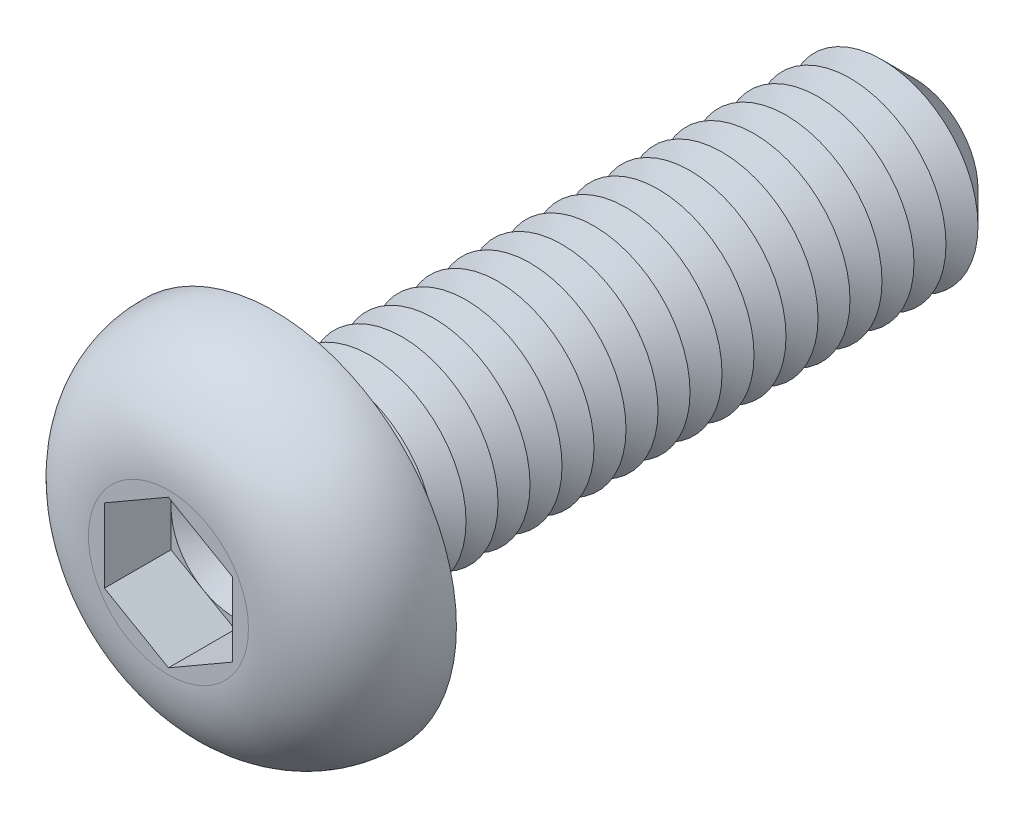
ISO-10303-21;
HEADER;
FILE_DESCRIPTION(('STEP AP214'),'2;1');
FILE_NAME('part.step','',(''),(''),'','','');
FILE_SCHEMA(('AUTOMOTIVE_DESIGN { 1 0 10303 214 1 1 1 1 }'));
ENDSEC;
DATA;
#1=APPLICATION_CONTEXT('core data for automotive mechanical design processes');
#2=APPLICATION_PROTOCOL_DEFINITION('international standard','automotive_design',2000,#1);
#3=PRODUCT_CONTEXT('',#1,'mechanical');
#4=PRODUCT('Part','Part','',(#3));
#5=PRODUCT_RELATED_PRODUCT_CATEGORY('part','',(#4));
#6=PRODUCT_DEFINITION_FORMATION('','',#4);
#7=PRODUCT_DEFINITION_CONTEXT('part definition',#1,'design');
#8=PRODUCT_DEFINITION('design','',#6,#7);
#9=PRODUCT_DEFINITION_SHAPE('','',#8);
#10=(LENGTH_UNIT() NAMED_UNIT(*) SI_UNIT(.MILLI.,.METRE.));
#11=(NAMED_UNIT(*) PLANE_ANGLE_UNIT() SI_UNIT($,.RADIAN.));
#12=(NAMED_UNIT(*) SI_UNIT($,.STERADIAN.) SOLID_ANGLE_UNIT());
#13=UNCERTAINTY_MEASURE_WITH_UNIT(LENGTH_MEASURE(1.E-05),#10,'distance_accuracy_value','');
#14=(GEOMETRIC_REPRESENTATION_CONTEXT(3) GLOBAL_UNCERTAINTY_ASSIGNED_CONTEXT((#13)) GLOBAL_UNIT_ASSIGNED_CONTEXT((#10,
#11,#12)) REPRESENTATION_CONTEXT('',''));
#15=CARTESIAN_POINT('',(0.,0.,0.));
#16=DIRECTION('',(0.,0.,1.));
#17=DIRECTION('',(1.,0.,0.));
#18=AXIS2_PLACEMENT_3D('',#15,#16,#17);
#19=CARTESIAN_POINT('',(0.,0.,0.61));
#20=DIRECTION('',(0.,0.,1.));
#21=DIRECTION('',(1.,0.,0.));
#22=AXIS2_PLACEMENT_3D('',#19,#20,#21);
#23=PLANE('',#22);
#24=CARTESIAN_POINT('',(0.,0.,0.61));
#25=DIRECTION('',(0.,0.,1.));
#26=DIRECTION('',(1.,0.,0.));
#27=AXIS2_PLACEMENT_3D('',#24,#25,#26);
#28=CIRCLE('',#27,1.);
#29=CARTESIAN_POINT('',(1.,0.,0.61));
#30=VERTEX_POINT('',#29);
#31=CARTESIAN_POINT('',(0.5,0.866025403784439,0.61));
#32=VERTEX_POINT('',#31);
#33=EDGE_CURVE('E117',#30,#32,#28,.T.);
#34=ORIENTED_EDGE('',*,*,#33,.F.);
#35=DIRECTION('',(0.,1.,0.));
#36=VECTOR('',#35,1.);
#37=CARTESIAN_POINT('',(1.,-0.577350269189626,0.61));
#38=LINE('',#37,#36);
#39=CARTESIAN_POINT('',(1.,0.577350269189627,0.61));
#40=VERTEX_POINT('',#39);
#41=EDGE_CURVE('E140',#30,#40,#38,.T.);
#42=ORIENTED_EDGE('',*,*,#41,.T.);
#43=DIRECTION('',(-0.866025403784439,0.5,0.));
#44=VECTOR('',#43,1.);
#45=CARTESIAN_POINT('',(1.,0.577350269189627,0.61));
#46=LINE('',#45,#44);
#47=EDGE_CURVE('E135',#40,#32,#46,.T.);
#48=ORIENTED_EDGE('',*,*,#47,.T.);
#49=EDGE_LOOP('',(#34,#42,#48));
#50=FACE_BOUND('',#49,.T.);
#51=ADVANCED_FACE('F39',(#50),#23,.T.);
#52=CARTESIAN_POINT('',(0.,0.,0.61));
#53=DIRECTION('',(0.,0.,1.));
#54=DIRECTION('',(1.,0.,0.));
#55=AXIS2_PLACEMENT_3D('',#52,#53,#54);
#56=CIRCLE('',#55,1.);
#57=CARTESIAN_POINT('',(-0.5,0.866025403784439,0.61));
#58=VERTEX_POINT('',#57);
#59=EDGE_CURVE('E11',#32,#58,#56,.T.);
#60=ORIENTED_EDGE('',*,*,#59,.F.);
#61=CARTESIAN_POINT('',(0.,1.15470053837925,0.61));
#62=VERTEX_POINT('',#61);
#63=EDGE_CURVE('E130',#32,#62,#46,.T.);
#64=ORIENTED_EDGE('',*,*,#63,.T.);
#65=DIRECTION('',(-0.866025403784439,-0.5,0.));
#66=VECTOR('',#65,1.);
#67=CARTESIAN_POINT('',(0.,1.15470053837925,0.61));
#68=LINE('',#67,#66);
#69=EDGE_CURVE('E132',#62,#58,#68,.T.);
#70=ORIENTED_EDGE('',*,*,#69,.T.);
#71=EDGE_LOOP('',(#60,#64,#70));
#72=FACE_BOUND('',#71,.T.);
#73=ADVANCED_FACE('F129',(#72),#23,.T.);
#74=CARTESIAN_POINT('',(-1.,0.,0.61));
#75=VERTEX_POINT('',#74);
#76=EDGE_CURVE('E49',#58,#75,#56,.T.);
#77=ORIENTED_EDGE('',*,*,#76,.F.);
#78=CARTESIAN_POINT('',(-1.,0.577350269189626,0.61));
#79=VERTEX_POINT('',#78);
#80=EDGE_CURVE('E143',#58,#79,#68,.T.);
#81=ORIENTED_EDGE('',*,*,#80,.T.);
#82=DIRECTION('',(0.,-1.,0.));
#83=VECTOR('',#82,1.);
#84=CARTESIAN_POINT('',(-1.,0.577350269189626,0.61));
#85=LINE('',#84,#83);
#86=EDGE_CURVE('E154',#79,#75,#85,.T.);
#87=ORIENTED_EDGE('',*,*,#86,.T.);
#88=EDGE_LOOP('',(#77,#81,#87));
#89=FACE_BOUND('',#88,.T.);
#90=ADVANCED_FACE('F250',(#89),#23,.T.);
#91=CARTESIAN_POINT('',(-0.5,-0.866025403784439,0.61));
#92=VERTEX_POINT('',#91);
#93=EDGE_CURVE('E234',#75,#92,#56,.T.);
#94=ORIENTED_EDGE('',*,*,#93,.F.);
#95=CARTESIAN_POINT('',(-1.,-0.577350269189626,0.61));
#96=VERTEX_POINT('',#95);
#97=EDGE_CURVE('E153',#75,#96,#85,.T.);
#98=ORIENTED_EDGE('',*,*,#97,.T.);
#99=DIRECTION('',(0.866025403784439,-0.5,0.));
#100=VECTOR('',#99,1.);
#101=CARTESIAN_POINT('',(-1.,-0.577350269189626,0.61));
#102=LINE('',#101,#100);
#103=EDGE_CURVE('E159',#96,#92,#102,.T.);
#104=ORIENTED_EDGE('',*,*,#103,.T.);
#105=EDGE_LOOP('',(#94,#98,#104));
#106=FACE_BOUND('',#105,.T.);
#107=ADVANCED_FACE('F243',(#106),#23,.T.);
#108=CARTESIAN_POINT('',(0.5,-0.866025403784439,0.61));
#109=VERTEX_POINT('',#108);
#110=EDGE_CURVE('E56',#92,#109,#56,.T.);
#111=ORIENTED_EDGE('',*,*,#110,.F.);
#112=CARTESIAN_POINT('',(0.,-1.15470053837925,0.61));
#113=VERTEX_POINT('',#112);
#114=EDGE_CURVE('E158',#92,#113,#102,.T.);
#115=ORIENTED_EDGE('',*,*,#114,.T.);
#116=DIRECTION('',(0.866025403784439,0.5,0.));
#117=VECTOR('',#116,1.);
#118=CARTESIAN_POINT('',(0.,-1.15470053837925,0.61));
#119=LINE('',#118,#117);
#120=EDGE_CURVE('E164',#113,#109,#119,.T.);
#121=ORIENTED_EDGE('',*,*,#120,.T.);
#122=EDGE_LOOP('',(#111,#115,#121));
#123=FACE_BOUND('',#122,.T.);
#124=ADVANCED_FACE('F336',(#123),#23,.T.);
#125=CARTESIAN_POINT('',(0.,0.,-10.));
#126=DIRECTION('',(0.,0.,1.));
#127=DIRECTION('',(1.,0.,0.));
#128=AXIS2_PLACEMENT_3D('',#125,#126,#127);
#129=CYLINDRICAL_SURFACE('',#128,1.5);
#130=CARTESIAN_POINT('',(0.,0.,-0.200000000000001));
#131=DIRECTION('',(0.,0.,1.));
#132=DIRECTION('',(1.,0.,0.));
#133=AXIS2_PLACEMENT_3D('',#130,#131,#132);
#134=CIRCLE('',#133,1.5);
#135=CARTESIAN_POINT('',(1.5,0.,-0.200000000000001));
#136=VERTEX_POINT('',#135);
#137=EDGE_CURVE('E222',#136,#136,#134,.F.);
#138=ORIENTED_EDGE('',*,*,#137,.T.);
#139=EDGE_LOOP('',(#138));
#140=FACE_BOUND('',#139,.T.);
#141=CARTESIAN_POINT('',(0.,0.,-0.5));
#142=DIRECTION('',(0.,0.,1.));
#143=DIRECTION('',(1.,0.,0.));
#144=AXIS2_PLACEMENT_3D('',#141,#142,#143);
#145=CIRCLE('',#144,1.50000000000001);
#146=CARTESIAN_POINT('',(1.50000000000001,0.,-0.5));
#147=VERTEX_POINT('',#146);
#148=EDGE_CURVE('E149',#147,#147,#145,.T.);
#149=ORIENTED_EDGE('',*,*,#148,.T.);
#150=EDGE_LOOP('',(#149));
#151=FACE_BOUND('',#150,.T.);
#152=ADVANCED_FACE('F320',(#140,#151),#129,.T.);
#153=CARTESIAN_POINT('',(0.,2.85,0.));
#154=DIRECTION('',(0.,0.,1.));
#155=DIRECTION('',(1.,0.,0.));
#156=AXIS2_PLACEMENT_3D('',#153,#154,#155);
#157=PLANE('',#156);
#158=CARTESIAN_POINT('',(0.,0.,0.));
#159=DIRECTION('',(0.,0.,1.));
#160=DIRECTION('',(1.,0.,0.));
#161=AXIS2_PLACEMENT_3D('',#158,#159,#160);
#162=CIRCLE('',#161,1.7);
#163=CARTESIAN_POINT('',(1.7,0.,0.));
#164=VERTEX_POINT('',#163);
#165=EDGE_CURVE('E225',#164,#164,#162,.T.);
#166=ORIENTED_EDGE('',*,*,#165,.T.);
#167=EDGE_LOOP('',(#166));
#168=FACE_BOUND('',#167,.T.);
#169=CARTESIAN_POINT('',(0.,0.,0.));
#170=DIRECTION('',(0.,0.,1.));
#171=DIRECTION('',(1.,0.,0.));
#172=AXIS2_PLACEMENT_3D('',#169,#170,#171);
#173=CIRCLE('',#172,2.85);
#174=CARTESIAN_POINT('',(2.85,0.,0.));
#175=VERTEX_POINT('',#174);
#176=EDGE_CURVE('E196',#175,#175,#173,.T.);
#177=ORIENTED_EDGE('',*,*,#176,.F.);
#178=EDGE_LOOP('',(#177));
#179=FACE_BOUND('',#178,.T.);
#180=ADVANCED_FACE('F366',(#168,#179),#157,.F.);
#181=CARTESIAN_POINT('',(0.,0.,1.65));
#182=DIRECTION('',(0.,0.,-1.));
#183=DIRECTION('',(-1.,0.,0.));
#184=AXIS2_PLACEMENT_3D('',#181,#182,#183);
#185=PLANE('',#184);
#186=DIRECTION('',(-0.866025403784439,-0.5,0.));
#187=VECTOR('',#186,1.);
#188=CARTESIAN_POINT('',(0.,1.15470053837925,1.65));
#189=LINE('',#188,#187);
#190=CARTESIAN_POINT('',(0.,1.15470053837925,1.65));
#191=VERTEX_POINT('',#190);
#192=CARTESIAN_POINT('',(-1.,0.577350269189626,1.65));
#193=VERTEX_POINT('',#192);
#194=EDGE_CURVE('E174',#191,#193,#189,.T.);
#195=ORIENTED_EDGE('',*,*,#194,.F.);
#196=DIRECTION('',(-0.866025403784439,0.5,0.));
#197=VECTOR('',#196,1.);
#198=CARTESIAN_POINT('',(1.,0.577350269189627,1.65));
#199=LINE('',#198,#197);
#200=CARTESIAN_POINT('',(1.,0.577350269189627,1.65));
#201=VERTEX_POINT('',#200);
#202=EDGE_CURVE('E64',#201,#191,#199,.T.);
#203=ORIENTED_EDGE('',*,*,#202,.F.);
#204=DIRECTION('',(0.,1.,0.));
#205=VECTOR('',#204,1.);
#206=CARTESIAN_POINT('',(1.,-0.577350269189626,1.65));
#207=LINE('',#206,#205);
#208=CARTESIAN_POINT('',(1.,-0.577350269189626,1.65));
#209=VERTEX_POINT('',#208);
#210=EDGE_CURVE('E138',#209,#201,#207,.T.);
#211=ORIENTED_EDGE('',*,*,#210,.F.);
#212=DIRECTION('',(0.866025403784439,0.5,0.));
#213=VECTOR('',#212,1.);
#214=CARTESIAN_POINT('',(0.,-1.15470053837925,1.65));
#215=LINE('',#214,#213);
#216=CARTESIAN_POINT('',(0.,-1.15470053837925,1.65));
#217=VERTEX_POINT('',#216);
#218=EDGE_CURVE('E186',#217,#209,#215,.T.);
#219=ORIENTED_EDGE('',*,*,#218,.F.);
#220=DIRECTION('',(0.866025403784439,-0.5,0.));
#221=VECTOR('',#220,1.);
#222=CARTESIAN_POINT('',(-1.,-0.577350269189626,1.65));
#223=LINE('',#222,#221);
#224=CARTESIAN_POINT('',(-1.,-0.577350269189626,1.65));
#225=VERTEX_POINT('',#224);
#226=EDGE_CURVE('E182',#225,#217,#223,.T.);
#227=ORIENTED_EDGE('',*,*,#226,.F.);
#228=DIRECTION('',(0.,-1.,0.));
#229=VECTOR('',#228,1.);
#230=CARTESIAN_POINT('',(-1.,0.577350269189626,1.65));
#231=LINE('',#230,#229);
#232=EDGE_CURVE('E178',#193,#225,#231,.T.);
#233=ORIENTED_EDGE('',*,*,#232,.F.);
#234=EDGE_LOOP('',(#195,#203,#211,#219,#227,#233));
#235=FACE_BOUND('',#234,.T.);
#236=CARTESIAN_POINT('',(0.,0.,1.65));
#237=DIRECTION('',(0.,0.,1.));
#238=DIRECTION('',(1.,0.,0.));
#239=AXIS2_PLACEMENT_3D('',#236,#237,#238);
#240=CIRCLE('',#239,1.25078144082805);
#241=CARTESIAN_POINT('',(1.25078144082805,0.,1.65));
#242=VERTEX_POINT('',#241);
#243=EDGE_CURVE('E214',#242,#242,#240,.T.);
#244=ORIENTED_EDGE('',*,*,#243,.T.);
#245=EDGE_LOOP('',(#244));
#246=FACE_BOUND('',#245,.T.);
#247=ADVANCED_FACE('F259',(#235,#246),#185,.F.);
#248=CARTESIAN_POINT('',(0.,0.,0.0499999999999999));
#249=DIRECTION('',(0.,0.,1.));
#250=DIRECTION('',(1.,0.,0.));
#251=AXIS2_PLACEMENT_3D('',#248,#249,#250);
#252=DEGENERATE_TOROIDAL_SURFACE('',#251,1.25078144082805,1.6,.T.);
#253=ORIENTED_EDGE('',*,*,#243,.F.);
#254=EDGE_LOOP('',(#253));
#255=FACE_BOUND('',#254,.T.);
#256=ORIENTED_EDGE('',*,*,#176,.T.);
#257=EDGE_LOOP('',(#256));
#258=FACE_BOUND('',#257,.T.);
#259=ADVANCED_FACE('F360',(#255,#258),#252,.T.);
#260=CARTESIAN_POINT('',(1.,0.577350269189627,0.61));
#261=DIRECTION('',(0.5,0.866025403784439,0.));
#262=DIRECTION('',(-0.866025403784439,0.5,0.));
#263=AXIS2_PLACEMENT_3D('',#260,#261,#262);
#264=PLANE('',#263);
#265=ORIENTED_EDGE('',*,*,#202,.T.);
#266=DIRECTION('',(0.,0.,1.));
#267=VECTOR('',#266,1.);
#268=CARTESIAN_POINT('',(0.,1.15470053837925,0.61));
#269=LINE('',#268,#267);
#270=EDGE_CURVE('E136',#62,#191,#269,.T.);
#271=ORIENTED_EDGE('',*,*,#270,.F.);
#272=ORIENTED_EDGE('',*,*,#63,.F.);
#273=ORIENTED_EDGE('',*,*,#47,.F.);
#274=DIRECTION('',(0.,0.,1.));
#275=VECTOR('',#274,1.);
#276=CARTESIAN_POINT('',(1.,0.577350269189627,0.61));
#277=LINE('',#276,#275);
#278=EDGE_CURVE('E193',#40,#201,#277,.T.);
#279=ORIENTED_EDGE('',*,*,#278,.T.);
#280=EDGE_LOOP('',(#265,#271,#272,#273,#279));
#281=FACE_BOUND('',#280,.T.);
#282=ADVANCED_FACE('F134',(#281),#264,.F.);
#283=CARTESIAN_POINT('',(1.,-0.577350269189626,0.61));
#284=DIRECTION('',(1.,0.,0.));
#285=DIRECTION('',(0.,0.,-1.));
#286=AXIS2_PLACEMENT_3D('',#283,#284,#285);
#287=PLANE('',#286);
#288=ORIENTED_EDGE('',*,*,#210,.T.);
#289=ORIENTED_EDGE('',*,*,#278,.F.);
#290=ORIENTED_EDGE('',*,*,#41,.F.);
#291=CARTESIAN_POINT('',(1.,-0.577350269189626,0.61));
#292=VERTEX_POINT('',#291);
#293=EDGE_CURVE('E168',#292,#30,#38,.T.);
#294=ORIENTED_EDGE('',*,*,#293,.F.);
#295=DIRECTION('',(0.,0.,1.));
#296=VECTOR('',#295,1.);
#297=CARTESIAN_POINT('',(1.,-0.577350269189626,0.61));
#298=LINE('',#297,#296);
#299=EDGE_CURVE('E197',#292,#209,#298,.T.);
#300=ORIENTED_EDGE('',*,*,#299,.T.);
#301=EDGE_LOOP('',(#288,#289,#290,#294,#300));
#302=FACE_BOUND('',#301,.T.);
#303=ADVANCED_FACE('F344',(#302),#287,.F.);
#304=CARTESIAN_POINT('',(0.,-1.15470053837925,0.61));
#305=DIRECTION('',(0.5,-0.866025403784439,0.));
#306=DIRECTION('',(0.866025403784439,0.5,0.));
#307=AXIS2_PLACEMENT_3D('',#304,#305,#306);
#308=PLANE('',#307);
#309=ORIENTED_EDGE('',*,*,#218,.T.);
#310=ORIENTED_EDGE('',*,*,#299,.F.);
#311=EDGE_CURVE('E163',#109,#292,#119,.T.);
#312=ORIENTED_EDGE('',*,*,#311,.F.);
#313=ORIENTED_EDGE('',*,*,#120,.F.);
#314=DIRECTION('',(0.,0.,1.));
#315=VECTOR('',#314,1.);
#316=CARTESIAN_POINT('',(0.,-1.15470053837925,0.61));
#317=LINE('',#316,#315);
#318=EDGE_CURVE('E200',#113,#217,#317,.T.);
#319=ORIENTED_EDGE('',*,*,#318,.T.);
#320=EDGE_LOOP('',(#309,#310,#312,#313,#319));
#321=FACE_BOUND('',#320,.T.);
#322=ADVANCED_FACE('F347',(#321),#308,.F.);
#323=CARTESIAN_POINT('',(-1.,-0.577350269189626,0.61));
#324=DIRECTION('',(-0.5,-0.866025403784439,0.));
#325=DIRECTION('',(0.866025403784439,-0.5,0.));
#326=AXIS2_PLACEMENT_3D('',#323,#324,#325);
#327=PLANE('',#326);
#328=ORIENTED_EDGE('',*,*,#226,.T.);
#329=ORIENTED_EDGE('',*,*,#318,.F.);
#330=ORIENTED_EDGE('',*,*,#114,.F.);
#331=ORIENTED_EDGE('',*,*,#103,.F.);
#332=DIRECTION('',(0.,0.,1.));
#333=VECTOR('',#332,1.);
#334=CARTESIAN_POINT('',(-1.,-0.577350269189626,0.61));
#335=LINE('',#334,#333);
#336=EDGE_CURVE('E203',#96,#225,#335,.T.);
#337=ORIENTED_EDGE('',*,*,#336,.T.);
#338=EDGE_LOOP('',(#328,#329,#330,#331,#337));
#339=FACE_BOUND('',#338,.T.);
#340=ADVANCED_FACE('F264',(#339),#327,.F.);
#341=CARTESIAN_POINT('',(-1.,0.577350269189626,0.61));
#342=DIRECTION('',(-1.,0.,0.));
#343=DIRECTION('',(0.,-1.,0.));
#344=AXIS2_PLACEMENT_3D('',#341,#342,#343);
#345=PLANE('',#344);
#346=ORIENTED_EDGE('',*,*,#232,.T.);
#347=ORIENTED_EDGE('',*,*,#336,.F.);
#348=ORIENTED_EDGE('',*,*,#97,.F.);
#349=ORIENTED_EDGE('',*,*,#86,.F.);
#350=DIRECTION('',(0.,0.,1.));
#351=VECTOR('',#350,1.);
#352=CARTESIAN_POINT('',(-1.,0.577350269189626,0.61));
#353=LINE('',#352,#351);
#354=EDGE_CURVE('E206',#79,#193,#353,.T.);
#355=ORIENTED_EDGE('',*,*,#354,.T.);
#356=EDGE_LOOP('',(#346,#347,#348,#349,#355));
#357=FACE_BOUND('',#356,.T.);
#358=ADVANCED_FACE('F248',(#357),#345,.F.);
#359=CARTESIAN_POINT('',(0.,1.15470053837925,0.61));
#360=DIRECTION('',(-0.5,0.866025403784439,0.));
#361=DIRECTION('',(-0.866025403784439,-0.5,0.));
#362=AXIS2_PLACEMENT_3D('',#359,#360,#361);
#363=PLANE('',#362);
#364=ORIENTED_EDGE('',*,*,#194,.T.);
#365=ORIENTED_EDGE('',*,*,#354,.F.);
#366=ORIENTED_EDGE('',*,*,#80,.F.);
#367=ORIENTED_EDGE('',*,*,#69,.F.);
#368=ORIENTED_EDGE('',*,*,#270,.T.);
#369=EDGE_LOOP('',(#364,#365,#366,#367,#368));
#370=FACE_BOUND('',#369,.T.);
#371=ADVANCED_FACE('F253',(#370),#363,.F.);
#372=EDGE_CURVE('E43',#109,#30,#56,.T.);
#373=ORIENTED_EDGE('',*,*,#372,.F.);
#374=ORIENTED_EDGE('',*,*,#311,.T.);
#375=ORIENTED_EDGE('',*,*,#293,.T.);
#376=EDGE_LOOP('',(#373,#374,#375));
#377=FACE_BOUND('',#376,.T.);
#378=ADVANCED_FACE('F325',(#377),#23,.T.);
#379=CARTESIAN_POINT('',(0.,0.,-0.5));
#380=DIRECTION('',(0.,0.,1.));
#381=DIRECTION('',(1.,0.,0.));
#382=AXIS2_PLACEMENT_3D('',#379,#380,#381);
#383=CONICAL_SURFACE('',#382,1.50000000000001,1.0471975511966);
#384=CARTESIAN_POINT('',(0.,0.,-0.750000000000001));
#385=DIRECTION('',(0.,0.,1.));
#386=DIRECTION('',(1.,0.,0.));
#387=AXIS2_PLACEMENT_3D('',#384,#385,#386);
#388=CIRCLE('',#387,1.06698729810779);
#389=CARTESIAN_POINT('',(1.06698729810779,0.,-0.750000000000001));
#390=VERTEX_POINT('',#389);
#391=EDGE_CURVE('E309',#390,#390,#388,.T.);
#392=ORIENTED_EDGE('',*,*,#391,.T.);
#393=EDGE_LOOP('',(#392));
#394=FACE_BOUND('',#393,.T.);
#395=ORIENTED_EDGE('',*,*,#148,.F.);
#396=EDGE_LOOP('',(#395));
#397=FACE_BOUND('',#396,.T.);
#398=ADVANCED_FACE('F322',(#394,#397),#383,.T.);
#399=CARTESIAN_POINT('',(0.,0.,-0.750000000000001));
#400=DIRECTION('',(0.,0.,-1.));
#401=DIRECTION('',(-1.,0.,0.));
#402=AXIS2_PLACEMENT_3D('',#399,#400,#401);
#403=CONICAL_SURFACE('',#402,1.06698729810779,1.0471975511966);
#404=CARTESIAN_POINT('',(0.,0.,-1.));
#405=DIRECTION('',(0.,0.,1.));
#406=DIRECTION('',(1.,0.,0.));
#407=AXIS2_PLACEMENT_3D('',#404,#405,#406);
#408=CIRCLE('',#407,1.50000000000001);
#409=CARTESIAN_POINT('',(1.50000000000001,0.,-1.));
#410=VERTEX_POINT('',#409);
#411=EDGE_CURVE('E306',#410,#410,#408,.T.);
#412=ORIENTED_EDGE('',*,*,#411,.T.);
#413=EDGE_LOOP('',(#412));
#414=FACE_BOUND('',#413,.T.);
#415=ORIENTED_EDGE('',*,*,#391,.F.);
#416=EDGE_LOOP('',(#415));
#417=FACE_BOUND('',#416,.T.);
#418=ADVANCED_FACE('F324',(#414,#417),#403,.T.);
#419=CARTESIAN_POINT('',(0.,0.,-1.));
#420=DIRECTION('',(0.,0.,1.));
#421=DIRECTION('',(1.,0.,0.));
#422=AXIS2_PLACEMENT_3D('',#419,#420,#421);
#423=CONICAL_SURFACE('',#422,1.50000000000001,1.0471975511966);
#424=CARTESIAN_POINT('',(0.,0.,-1.25));
#425=DIRECTION('',(0.,0.,1.));
#426=DIRECTION('',(1.,0.,0.));
#427=AXIS2_PLACEMENT_3D('',#424,#425,#426);
#428=CIRCLE('',#427,1.06698729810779);
#429=CARTESIAN_POINT('',(1.06698729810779,0.,-1.25));
#430=VERTEX_POINT('',#429);
#431=EDGE_CURVE('E302',#430,#430,#428,.T.);
#432=ORIENTED_EDGE('',*,*,#431,.T.);
#433=EDGE_LOOP('',(#432));
#434=FACE_BOUND('',#433,.T.);
#435=ORIENTED_EDGE('',*,*,#411,.F.);
#436=EDGE_LOOP('',(#435));
#437=FACE_BOUND('',#436,.T.);
#438=ADVANCED_FACE('F331',(#434,#437),#423,.T.);
#439=CARTESIAN_POINT('',(0.,0.,-1.25));
#440=DIRECTION('',(0.,0.,-1.));
#441=DIRECTION('',(-1.,0.,0.));
#442=AXIS2_PLACEMENT_3D('',#439,#440,#441);
#443=CONICAL_SURFACE('',#442,1.06698729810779,1.0471975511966);
#444=CARTESIAN_POINT('',(0.,0.,-1.5));
#445=DIRECTION('',(0.,0.,1.));
#446=DIRECTION('',(1.,0.,0.));
#447=AXIS2_PLACEMENT_3D('',#444,#445,#446);
#448=CIRCLE('',#447,1.50000000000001);
#449=CARTESIAN_POINT('',(1.50000000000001,0.,-1.5));
#450=VERTEX_POINT('',#449);
#451=EDGE_CURVE('E298',#450,#450,#448,.T.);
#452=ORIENTED_EDGE('',*,*,#451,.T.);
#453=EDGE_LOOP('',(#452));
#454=FACE_BOUND('',#453,.T.);
#455=ORIENTED_EDGE('',*,*,#431,.F.);
#456=EDGE_LOOP('',(#455));
#457=FACE_BOUND('',#456,.T.);
#458=ADVANCED_FACE('F520',(#454,#457),#443,.T.);
#459=CARTESIAN_POINT('',(0.,0.,-1.5));
#460=DIRECTION('',(0.,0.,1.));
#461=DIRECTION('',(1.,0.,0.));
#462=AXIS2_PLACEMENT_3D('',#459,#460,#461);
#463=CONICAL_SURFACE('',#462,1.50000000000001,1.0471975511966);
#464=CARTESIAN_POINT('',(0.,0.,-1.75));
#465=DIRECTION('',(0.,0.,1.));
#466=DIRECTION('',(1.,0.,0.));
#467=AXIS2_PLACEMENT_3D('',#464,#465,#466);
#468=CIRCLE('',#467,1.06698729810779);
#469=CARTESIAN_POINT('',(1.06698729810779,0.,-1.75));
#470=VERTEX_POINT('',#469);
#471=EDGE_CURVE('E295',#470,#470,#468,.T.);
#472=ORIENTED_EDGE('',*,*,#471,.T.);
#473=EDGE_LOOP('',(#472));
#474=FACE_BOUND('',#473,.T.);
#475=ORIENTED_EDGE('',*,*,#451,.F.);
#476=EDGE_LOOP('',(#475));
#477=FACE_BOUND('',#476,.T.);
#478=ADVANCED_FACE('F516',(#474,#477),#463,.T.);
#479=CARTESIAN_POINT('',(0.,0.,-1.75));
#480=DIRECTION('',(0.,0.,-1.));
#481=DIRECTION('',(-1.,0.,0.));
#482=AXIS2_PLACEMENT_3D('',#479,#480,#481);
#483=CONICAL_SURFACE('',#482,1.06698729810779,1.0471975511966);
#484=CARTESIAN_POINT('',(0.,0.,-2.));
#485=DIRECTION('',(0.,0.,1.));
#486=DIRECTION('',(1.,0.,0.));
#487=AXIS2_PLACEMENT_3D('',#484,#485,#486);
#488=CIRCLE('',#487,1.50000000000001);
#489=CARTESIAN_POINT('',(1.50000000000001,0.,-2.));
#490=VERTEX_POINT('',#489);
#491=EDGE_CURVE('E292',#490,#490,#488,.T.);
#492=ORIENTED_EDGE('',*,*,#491,.T.);
#493=EDGE_LOOP('',(#492));
#494=FACE_BOUND('',#493,.T.);
#495=ORIENTED_EDGE('',*,*,#471,.F.);
#496=EDGE_LOOP('',(#495));
#497=FACE_BOUND('',#496,.T.);
#498=ADVANCED_FACE('F512',(#494,#497),#483,.T.);
#499=CARTESIAN_POINT('',(0.,0.,-2.));
#500=DIRECTION('',(0.,0.,1.));
#501=DIRECTION('',(1.,0.,0.));
#502=AXIS2_PLACEMENT_3D('',#499,#500,#501);
#503=CONICAL_SURFACE('',#502,1.50000000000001,1.0471975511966);
#504=CARTESIAN_POINT('',(0.,0.,-2.25));
#505=DIRECTION('',(0.,0.,1.));
#506=DIRECTION('',(1.,0.,0.));
#507=AXIS2_PLACEMENT_3D('',#504,#505,#506);
#508=CIRCLE('',#507,1.06698729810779);
#509=CARTESIAN_POINT('',(1.06698729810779,0.,-2.25));
#510=VERTEX_POINT('',#509);
#511=EDGE_CURVE('E282',#510,#510,#508,.T.);
#512=ORIENTED_EDGE('',*,*,#511,.T.);
#513=EDGE_LOOP('',(#512));
#514=FACE_BOUND('',#513,.T.);
#515=ORIENTED_EDGE('',*,*,#491,.F.);
#516=EDGE_LOOP('',(#515));
#517=FACE_BOUND('',#516,.T.);
#518=ADVANCED_FACE('F508',(#514,#517),#503,.T.);
#519=CARTESIAN_POINT('',(0.,0.,-2.25));
#520=DIRECTION('',(0.,0.,-1.));
#521=DIRECTION('',(-1.,0.,0.));
#522=AXIS2_PLACEMENT_3D('',#519,#520,#521);
#523=CONICAL_SURFACE('',#522,1.06698729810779,1.0471975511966);
#524=CARTESIAN_POINT('',(0.,0.,-2.5));
#525=DIRECTION('',(0.,0.,1.));
#526=DIRECTION('',(1.,0.,0.));
#527=AXIS2_PLACEMENT_3D('',#524,#525,#526);
#528=CIRCLE('',#527,1.50000000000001);
#529=CARTESIAN_POINT('',(1.50000000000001,0.,-2.5));
#530=VERTEX_POINT('',#529);
#531=EDGE_CURVE('E275',#530,#530,#528,.T.);
#532=ORIENTED_EDGE('',*,*,#531,.T.);
#533=EDGE_LOOP('',(#532));
#534=FACE_BOUND('',#533,.T.);
#535=ORIENTED_EDGE('',*,*,#511,.F.);
#536=EDGE_LOOP('',(#535));
#537=FACE_BOUND('',#536,.T.);
#538=ADVANCED_FACE('F505',(#534,#537),#523,.T.);
#539=CARTESIAN_POINT('',(0.,0.,-2.5));
#540=DIRECTION('',(0.,0.,1.));
#541=DIRECTION('',(1.,0.,0.));
#542=AXIS2_PLACEMENT_3D('',#539,#540,#541);
#543=CONICAL_SURFACE('',#542,1.50000000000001,1.0471975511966);
#544=CARTESIAN_POINT('',(0.,0.,-2.75));
#545=DIRECTION('',(0.,0.,1.));
#546=DIRECTION('',(1.,0.,0.));
#547=AXIS2_PLACEMENT_3D('',#544,#545,#546);
#548=CIRCLE('',#547,1.06698729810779);
#549=CARTESIAN_POINT('',(1.06698729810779,0.,-2.75));
#550=VERTEX_POINT('',#549);
#551=EDGE_CURVE('E273',#550,#550,#548,.T.);
#552=ORIENTED_EDGE('',*,*,#551,.T.);
#553=EDGE_LOOP('',(#552));
#554=FACE_BOUND('',#553,.T.);
#555=ORIENTED_EDGE('',*,*,#531,.F.);
#556=EDGE_LOOP('',(#555));
#557=FACE_BOUND('',#556,.T.);
#558=ADVANCED_FACE('F501',(#554,#557),#543,.T.);
#559=CARTESIAN_POINT('',(0.,0.,-2.75));
#560=DIRECTION('',(0.,0.,-1.));
#561=DIRECTION('',(-1.,0.,0.));
#562=AXIS2_PLACEMENT_3D('',#559,#560,#561);
#563=CONICAL_SURFACE('',#562,1.06698729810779,1.0471975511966);
#564=CARTESIAN_POINT('',(0.,0.,-3.));
#565=DIRECTION('',(0.,0.,1.));
#566=DIRECTION('',(1.,0.,0.));
#567=AXIS2_PLACEMENT_3D('',#564,#565,#566);
#568=CIRCLE('',#567,1.50000000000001);
#569=CARTESIAN_POINT('',(1.50000000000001,0.,-3.));
#570=VERTEX_POINT('',#569);
#571=EDGE_CURVE('E276',#570,#570,#568,.T.);
#572=ORIENTED_EDGE('',*,*,#571,.T.);
#573=EDGE_LOOP('',(#572));
#574=FACE_BOUND('',#573,.T.);
#575=ORIENTED_EDGE('',*,*,#551,.F.);
#576=EDGE_LOOP('',(#575));
#577=FACE_BOUND('',#576,.T.);
#578=ADVANCED_FACE('F495',(#574,#577),#563,.T.);
#579=CARTESIAN_POINT('',(0.,0.,-3.));
#580=DIRECTION('',(0.,0.,1.));
#581=DIRECTION('',(1.,0.,0.));
#582=AXIS2_PLACEMENT_3D('',#579,#580,#581);
#583=CONICAL_SURFACE('',#582,1.50000000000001,1.0471975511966);
#584=CARTESIAN_POINT('',(0.,0.,-3.25));
#585=DIRECTION('',(0.,0.,1.));
#586=DIRECTION('',(1.,0.,0.));
#587=AXIS2_PLACEMENT_3D('',#584,#585,#586);
#588=CIRCLE('',#587,1.06698729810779);
#589=CARTESIAN_POINT('',(1.06698729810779,0.,-3.25));
#590=VERTEX_POINT('',#589);
#591=EDGE_CURVE('E271',#590,#590,#588,.T.);
#592=ORIENTED_EDGE('',*,*,#591,.T.);
#593=EDGE_LOOP('',(#592));
#594=FACE_BOUND('',#593,.T.);
#595=ORIENTED_EDGE('',*,*,#571,.F.);
#596=EDGE_LOOP('',(#595));
#597=FACE_BOUND('',#596,.T.);
#598=ADVANCED_FACE('F480',(#594,#597),#583,.T.);
#599=CARTESIAN_POINT('',(0.,0.,-3.25));
#600=DIRECTION('',(0.,0.,-1.));
#601=DIRECTION('',(-1.,0.,0.));
#602=AXIS2_PLACEMENT_3D('',#599,#600,#601);
#603=CONICAL_SURFACE('',#602,1.06698729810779,1.0471975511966);
#604=CARTESIAN_POINT('',(0.,0.,-3.5));
#605=DIRECTION('',(0.,0.,1.));
#606=DIRECTION('',(1.,0.,0.));
#607=AXIS2_PLACEMENT_3D('',#604,#605,#606);
#608=CIRCLE('',#607,1.50000000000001);
#609=CARTESIAN_POINT('',(1.50000000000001,0.,-3.5));
#610=VERTEX_POINT('',#609);
#611=EDGE_CURVE('E474',#610,#610,#608,.T.);
#612=ORIENTED_EDGE('',*,*,#611,.T.);
#613=EDGE_LOOP('',(#612));
#614=FACE_BOUND('',#613,.T.);
#615=ORIENTED_EDGE('',*,*,#591,.F.);
#616=EDGE_LOOP('',(#615));
#617=FACE_BOUND('',#616,.T.);
#618=ADVANCED_FACE('F483',(#614,#617),#603,.T.);
#619=CARTESIAN_POINT('',(0.,0.,-3.5));
#620=DIRECTION('',(0.,0.,1.));
#621=DIRECTION('',(1.,0.,0.));
#622=AXIS2_PLACEMENT_3D('',#619,#620,#621);
#623=CONICAL_SURFACE('',#622,1.50000000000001,1.0471975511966);
#624=CARTESIAN_POINT('',(0.,0.,-3.75));
#625=DIRECTION('',(0.,0.,1.));
#626=DIRECTION('',(1.,0.,0.));
#627=AXIS2_PLACEMENT_3D('',#624,#625,#626);
#628=CIRCLE('',#627,1.06698729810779);
#629=CARTESIAN_POINT('',(1.06698729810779,0.,-3.75));
#630=VERTEX_POINT('',#629);
#631=EDGE_CURVE('E471',#630,#630,#628,.T.);
#632=ORIENTED_EDGE('',*,*,#631,.T.);
#633=EDGE_LOOP('',(#632));
#634=FACE_BOUND('',#633,.T.);
#635=ORIENTED_EDGE('',*,*,#611,.F.);
#636=EDGE_LOOP('',(#635));
#637=FACE_BOUND('',#636,.T.);
#638=ADVANCED_FACE('F485',(#634,#637),#623,.T.);
#639=CARTESIAN_POINT('',(0.,0.,-3.75));
#640=DIRECTION('',(0.,0.,-1.));
#641=DIRECTION('',(-1.,0.,0.));
#642=AXIS2_PLACEMENT_3D('',#639,#640,#641);
#643=CONICAL_SURFACE('',#642,1.06698729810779,1.0471975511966);
#644=CARTESIAN_POINT('',(0.,0.,-4.));
#645=DIRECTION('',(0.,0.,1.));
#646=DIRECTION('',(1.,0.,0.));
#647=AXIS2_PLACEMENT_3D('',#644,#645,#646);
#648=CIRCLE('',#647,1.50000000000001);
#649=CARTESIAN_POINT('',(1.50000000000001,0.,-4.));
#650=VERTEX_POINT('',#649);
#651=EDGE_CURVE('E467',#650,#650,#648,.T.);
#652=ORIENTED_EDGE('',*,*,#651,.T.);
#653=EDGE_LOOP('',(#652));
#654=FACE_BOUND('',#653,.T.);
#655=ORIENTED_EDGE('',*,*,#631,.F.);
#656=EDGE_LOOP('',(#655));
#657=FACE_BOUND('',#656,.T.);
#658=ADVANCED_FACE('F492',(#654,#657),#643,.T.);
#659=CARTESIAN_POINT('',(0.,0.,-4.));
#660=DIRECTION('',(0.,0.,1.));
#661=DIRECTION('',(1.,0.,0.));
#662=AXIS2_PLACEMENT_3D('',#659,#660,#661);
#663=CONICAL_SURFACE('',#662,1.50000000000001,1.0471975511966);
#664=CARTESIAN_POINT('',(0.,0.,-4.25));
#665=DIRECTION('',(0.,0.,1.));
#666=DIRECTION('',(1.,0.,0.));
#667=AXIS2_PLACEMENT_3D('',#664,#665,#666);
#668=CIRCLE('',#667,1.06698729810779);
#669=CARTESIAN_POINT('',(1.06698729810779,0.,-4.25));
#670=VERTEX_POINT('',#669);
#671=EDGE_CURVE('E463',#670,#670,#668,.T.);
#672=ORIENTED_EDGE('',*,*,#671,.T.);
#673=EDGE_LOOP('',(#672));
#674=FACE_BOUND('',#673,.T.);
#675=ORIENTED_EDGE('',*,*,#651,.F.);
#676=EDGE_LOOP('',(#675));
#677=FACE_BOUND('',#676,.T.);
#678=ADVANCED_FACE('F575',(#674,#677),#663,.T.);
#679=CARTESIAN_POINT('',(0.,0.,-4.25));
#680=DIRECTION('',(0.,0.,-1.));
#681=DIRECTION('',(-1.,0.,0.));
#682=AXIS2_PLACEMENT_3D('',#679,#680,#681);
#683=CONICAL_SURFACE('',#682,1.06698729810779,1.0471975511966);
#684=CARTESIAN_POINT('',(0.,0.,-4.5));
#685=DIRECTION('',(0.,0.,1.));
#686=DIRECTION('',(1.,0.,0.));
#687=AXIS2_PLACEMENT_3D('',#684,#685,#686);
#688=CIRCLE('',#687,1.50000000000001);
#689=CARTESIAN_POINT('',(1.50000000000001,0.,-4.5));
#690=VERTEX_POINT('',#689);
#691=EDGE_CURVE('E459',#690,#690,#688,.T.);
#692=ORIENTED_EDGE('',*,*,#691,.T.);
#693=EDGE_LOOP('',(#692));
#694=FACE_BOUND('',#693,.T.);
#695=ORIENTED_EDGE('',*,*,#671,.F.);
#696=EDGE_LOOP('',(#695));
#697=FACE_BOUND('',#696,.T.);
#698=ADVANCED_FACE('F583',(#694,#697),#683,.T.);
#699=CARTESIAN_POINT('',(0.,0.,-4.5));
#700=DIRECTION('',(0.,0.,1.));
#701=DIRECTION('',(1.,0.,0.));
#702=AXIS2_PLACEMENT_3D('',#699,#700,#701);
#703=CONICAL_SURFACE('',#702,1.50000000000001,1.0471975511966);
#704=CARTESIAN_POINT('',(0.,0.,-4.75));
#705=DIRECTION('',(0.,0.,1.));
#706=DIRECTION('',(1.,0.,0.));
#707=AXIS2_PLACEMENT_3D('',#704,#705,#706);
#708=CIRCLE('',#707,1.06698729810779);
#709=CARTESIAN_POINT('',(1.06698729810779,0.,-4.75));
#710=VERTEX_POINT('',#709);
#711=EDGE_CURVE('E455',#710,#710,#708,.T.);
#712=ORIENTED_EDGE('',*,*,#711,.T.);
#713=EDGE_LOOP('',(#712));
#714=FACE_BOUND('',#713,.T.);
#715=ORIENTED_EDGE('',*,*,#691,.F.);
#716=EDGE_LOOP('',(#715));
#717=FACE_BOUND('',#716,.T.);
#718=ADVANCED_FACE('F592',(#714,#717),#703,.T.);
#719=CARTESIAN_POINT('',(0.,0.,-4.75));
#720=DIRECTION('',(0.,0.,-1.));
#721=DIRECTION('',(-1.,0.,0.));
#722=AXIS2_PLACEMENT_3D('',#719,#720,#721);
#723=CONICAL_SURFACE('',#722,1.06698729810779,1.0471975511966);
#724=CARTESIAN_POINT('',(0.,0.,-5.));
#725=DIRECTION('',(0.,0.,1.));
#726=DIRECTION('',(1.,0.,0.));
#727=AXIS2_PLACEMENT_3D('',#724,#725,#726);
#728=CIRCLE('',#727,1.50000000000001);
#729=CARTESIAN_POINT('',(1.50000000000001,0.,-5.));
#730=VERTEX_POINT('',#729);
#731=EDGE_CURVE('E451',#730,#730,#728,.T.);
#732=ORIENTED_EDGE('',*,*,#731,.T.);
#733=EDGE_LOOP('',(#732));
#734=FACE_BOUND('',#733,.T.);
#735=ORIENTED_EDGE('',*,*,#711,.F.);
#736=EDGE_LOOP('',(#735));
#737=FACE_BOUND('',#736,.T.);
#738=ADVANCED_FACE('F601',(#734,#737),#723,.T.);
#739=CARTESIAN_POINT('',(0.,0.,-5.));
#740=DIRECTION('',(0.,0.,1.));
#741=DIRECTION('',(1.,0.,0.));
#742=AXIS2_PLACEMENT_3D('',#739,#740,#741);
#743=CONICAL_SURFACE('',#742,1.50000000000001,1.0471975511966);
#744=CARTESIAN_POINT('',(0.,0.,-5.25));
#745=DIRECTION('',(0.,0.,1.));
#746=DIRECTION('',(1.,0.,0.));
#747=AXIS2_PLACEMENT_3D('',#744,#745,#746);
#748=CIRCLE('',#747,1.06698729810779);
#749=CARTESIAN_POINT('',(1.06698729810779,0.,-5.25));
#750=VERTEX_POINT('',#749);
#751=EDGE_CURVE('E448',#750,#750,#748,.T.);
#752=ORIENTED_EDGE('',*,*,#751,.T.);
#753=EDGE_LOOP('',(#752));
#754=FACE_BOUND('',#753,.T.);
#755=ORIENTED_EDGE('',*,*,#731,.F.);
#756=EDGE_LOOP('',(#755));
#757=FACE_BOUND('',#756,.T.);
#758=ADVANCED_FACE('F610',(#754,#757),#743,.T.);
#759=CARTESIAN_POINT('',(0.,0.,-5.25));
#760=DIRECTION('',(0.,0.,-1.));
#761=DIRECTION('',(-1.,0.,0.));
#762=AXIS2_PLACEMENT_3D('',#759,#760,#761);
#763=CONICAL_SURFACE('',#762,1.06698729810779,1.0471975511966);
#764=CARTESIAN_POINT('',(0.,0.,-5.5));
#765=DIRECTION('',(0.,0.,1.));
#766=DIRECTION('',(1.,0.,0.));
#767=AXIS2_PLACEMENT_3D('',#764,#765,#766);
#768=CIRCLE('',#767,1.50000000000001);
#769=CARTESIAN_POINT('',(1.50000000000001,0.,-5.5));
#770=VERTEX_POINT('',#769);
#771=EDGE_CURVE('E444',#770,#770,#768,.T.);
#772=ORIENTED_EDGE('',*,*,#771,.T.);
#773=EDGE_LOOP('',(#772));
#774=FACE_BOUND('',#773,.T.);
#775=ORIENTED_EDGE('',*,*,#751,.F.);
#776=EDGE_LOOP('',(#775));
#777=FACE_BOUND('',#776,.T.);
#778=ADVANCED_FACE('F619',(#774,#777),#763,.T.);
#779=CARTESIAN_POINT('',(0.,0.,-5.5));
#780=DIRECTION('',(0.,0.,1.));
#781=DIRECTION('',(1.,0.,0.));
#782=AXIS2_PLACEMENT_3D('',#779,#780,#781);
#783=CONICAL_SURFACE('',#782,1.50000000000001,1.0471975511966);
#784=CARTESIAN_POINT('',(0.,0.,-5.75));
#785=DIRECTION('',(0.,0.,1.));
#786=DIRECTION('',(1.,0.,0.));
#787=AXIS2_PLACEMENT_3D('',#784,#785,#786);
#788=CIRCLE('',#787,1.06698729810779);
#789=CARTESIAN_POINT('',(1.06698729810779,0.,-5.75));
#790=VERTEX_POINT('',#789);
#791=EDGE_CURVE('E440',#790,#790,#788,.T.);
#792=ORIENTED_EDGE('',*,*,#791,.T.);
#793=EDGE_LOOP('',(#792));
#794=FACE_BOUND('',#793,.T.);
#795=ORIENTED_EDGE('',*,*,#771,.F.);
#796=EDGE_LOOP('',(#795));
#797=FACE_BOUND('',#796,.T.);
#798=ADVANCED_FACE('F628',(#794,#797),#783,.T.);
#799=CARTESIAN_POINT('',(0.,0.,-5.75));
#800=DIRECTION('',(0.,0.,-1.));
#801=DIRECTION('',(-1.,0.,0.));
#802=AXIS2_PLACEMENT_3D('',#799,#800,#801);
#803=CONICAL_SURFACE('',#802,1.06698729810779,1.0471975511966);
#804=CARTESIAN_POINT('',(0.,0.,-6.));
#805=DIRECTION('',(0.,0.,1.));
#806=DIRECTION('',(1.,0.,0.));
#807=AXIS2_PLACEMENT_3D('',#804,#805,#806);
#808=CIRCLE('',#807,1.50000000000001);
#809=CARTESIAN_POINT('',(1.50000000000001,0.,-6.));
#810=VERTEX_POINT('',#809);
#811=EDGE_CURVE('E436',#810,#810,#808,.T.);
#812=ORIENTED_EDGE('',*,*,#811,.T.);
#813=EDGE_LOOP('',(#812));
#814=FACE_BOUND('',#813,.T.);
#815=ORIENTED_EDGE('',*,*,#791,.F.);
#816=EDGE_LOOP('',(#815));
#817=FACE_BOUND('',#816,.T.);
#818=ADVANCED_FACE('F637',(#814,#817),#803,.T.);
#819=CARTESIAN_POINT('',(0.,0.,-6.));
#820=DIRECTION('',(0.,0.,1.));
#821=DIRECTION('',(1.,0.,0.));
#822=AXIS2_PLACEMENT_3D('',#819,#820,#821);
#823=CONICAL_SURFACE('',#822,1.50000000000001,1.0471975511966);
#824=CARTESIAN_POINT('',(0.,0.,-6.25));
#825=DIRECTION('',(0.,0.,1.));
#826=DIRECTION('',(1.,0.,0.));
#827=AXIS2_PLACEMENT_3D('',#824,#825,#826);
#828=CIRCLE('',#827,1.06698729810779);
#829=CARTESIAN_POINT('',(1.06698729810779,0.,-6.25));
#830=VERTEX_POINT('',#829);
#831=EDGE_CURVE('E432',#830,#830,#828,.T.);
#832=ORIENTED_EDGE('',*,*,#831,.T.);
#833=EDGE_LOOP('',(#832));
#834=FACE_BOUND('',#833,.T.);
#835=ORIENTED_EDGE('',*,*,#811,.F.);
#836=EDGE_LOOP('',(#835));
#837=FACE_BOUND('',#836,.T.);
#838=ADVANCED_FACE('F646',(#834,#837),#823,.T.);
#839=CARTESIAN_POINT('',(0.,0.,-6.25));
#840=DIRECTION('',(0.,0.,-1.));
#841=DIRECTION('',(-1.,0.,0.));
#842=AXIS2_PLACEMENT_3D('',#839,#840,#841);
#843=CONICAL_SURFACE('',#842,1.06698729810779,1.0471975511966);
#844=CARTESIAN_POINT('',(0.,0.,-6.5));
#845=DIRECTION('',(0.,0.,1.));
#846=DIRECTION('',(1.,0.,0.));
#847=AXIS2_PLACEMENT_3D('',#844,#845,#846);
#848=CIRCLE('',#847,1.50000000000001);
#849=CARTESIAN_POINT('',(1.50000000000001,0.,-6.5));
#850=VERTEX_POINT('',#849);
#851=EDGE_CURVE('E428',#850,#850,#848,.T.);
#852=ORIENTED_EDGE('',*,*,#851,.T.);
#853=EDGE_LOOP('',(#852));
#854=FACE_BOUND('',#853,.T.);
#855=ORIENTED_EDGE('',*,*,#831,.F.);
#856=EDGE_LOOP('',(#855));
#857=FACE_BOUND('',#856,.T.);
#858=ADVANCED_FACE('F655',(#854,#857),#843,.T.);
#859=CARTESIAN_POINT('',(0.,0.,-6.5));
#860=DIRECTION('',(0.,0.,1.));
#861=DIRECTION('',(1.,0.,0.));
#862=AXIS2_PLACEMENT_3D('',#859,#860,#861);
#863=CONICAL_SURFACE('',#862,1.50000000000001,1.0471975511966);
#864=CARTESIAN_POINT('',(0.,0.,-6.75));
#865=DIRECTION('',(0.,0.,1.));
#866=DIRECTION('',(1.,0.,0.));
#867=AXIS2_PLACEMENT_3D('',#864,#865,#866);
#868=CIRCLE('',#867,1.06698729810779);
#869=CARTESIAN_POINT('',(1.06698729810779,0.,-6.75));
#870=VERTEX_POINT('',#869);
#871=EDGE_CURVE('E424',#870,#870,#868,.T.);
#872=ORIENTED_EDGE('',*,*,#871,.T.);
#873=EDGE_LOOP('',(#872));
#874=FACE_BOUND('',#873,.T.);
#875=ORIENTED_EDGE('',*,*,#851,.F.);
#876=EDGE_LOOP('',(#875));
#877=FACE_BOUND('',#876,.T.);
#878=ADVANCED_FACE('F664',(#874,#877),#863,.T.);
#879=CARTESIAN_POINT('',(0.,0.,-6.75));
#880=DIRECTION('',(0.,0.,-1.));
#881=DIRECTION('',(-1.,0.,0.));
#882=AXIS2_PLACEMENT_3D('',#879,#880,#881);
#883=CONICAL_SURFACE('',#882,1.06698729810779,1.0471975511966);
#884=CARTESIAN_POINT('',(0.,0.,-7.));
#885=DIRECTION('',(0.,0.,1.));
#886=DIRECTION('',(1.,0.,0.));
#887=AXIS2_PLACEMENT_3D('',#884,#885,#886);
#888=CIRCLE('',#887,1.50000000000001);
#889=CARTESIAN_POINT('',(1.50000000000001,0.,-7.));
#890=VERTEX_POINT('',#889);
#891=EDGE_CURVE('E420',#890,#890,#888,.T.);
#892=ORIENTED_EDGE('',*,*,#891,.T.);
#893=EDGE_LOOP('',(#892));
#894=FACE_BOUND('',#893,.T.);
#895=ORIENTED_EDGE('',*,*,#871,.F.);
#896=EDGE_LOOP('',(#895));
#897=FACE_BOUND('',#896,.T.);
#898=ADVANCED_FACE('F673',(#894,#897),#883,.T.);
#899=CARTESIAN_POINT('',(0.,0.,-7.));
#900=DIRECTION('',(0.,0.,1.));
#901=DIRECTION('',(1.,0.,0.));
#902=AXIS2_PLACEMENT_3D('',#899,#900,#901);
#903=CONICAL_SURFACE('',#902,1.50000000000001,1.0471975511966);
#904=CARTESIAN_POINT('',(0.,0.,-7.25));
#905=DIRECTION('',(0.,0.,1.));
#906=DIRECTION('',(1.,0.,0.));
#907=AXIS2_PLACEMENT_3D('',#904,#905,#906);
#908=CIRCLE('',#907,1.06698729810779);
#909=CARTESIAN_POINT('',(1.06698729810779,0.,-7.25));
#910=VERTEX_POINT('',#909);
#911=EDGE_CURVE('E417',#910,#910,#908,.T.);
#912=ORIENTED_EDGE('',*,*,#911,.T.);
#913=EDGE_LOOP('',(#912));
#914=FACE_BOUND('',#913,.T.);
#915=ORIENTED_EDGE('',*,*,#891,.F.);
#916=EDGE_LOOP('',(#915));
#917=FACE_BOUND('',#916,.T.);
#918=ADVANCED_FACE('F682',(#914,#917),#903,.T.);
#919=CARTESIAN_POINT('',(0.,0.,-7.25));
#920=DIRECTION('',(0.,0.,-1.));
#921=DIRECTION('',(-1.,0.,0.));
#922=AXIS2_PLACEMENT_3D('',#919,#920,#921);
#923=CONICAL_SURFACE('',#922,1.06698729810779,1.0471975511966);
#924=CARTESIAN_POINT('',(0.,0.,-7.5));
#925=DIRECTION('',(0.,0.,1.));
#926=DIRECTION('',(1.,0.,0.));
#927=AXIS2_PLACEMENT_3D('',#924,#925,#926);
#928=CIRCLE('',#927,1.50000000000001);
#929=CARTESIAN_POINT('',(1.50000000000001,0.,-7.5));
#930=VERTEX_POINT('',#929);
#931=EDGE_CURVE('E414',#930,#930,#928,.T.);
#932=ORIENTED_EDGE('',*,*,#931,.T.);
#933=EDGE_LOOP('',(#932));
#934=FACE_BOUND('',#933,.T.);
#935=ORIENTED_EDGE('',*,*,#911,.F.);
#936=EDGE_LOOP('',(#935));
#937=FACE_BOUND('',#936,.T.);
#938=ADVANCED_FACE('F691',(#934,#937),#923,.T.);
#939=CARTESIAN_POINT('',(0.,0.,-7.5));
#940=DIRECTION('',(0.,0.,1.));
#941=DIRECTION('',(1.,0.,0.));
#942=AXIS2_PLACEMENT_3D('',#939,#940,#941);
#943=CONICAL_SURFACE('',#942,1.50000000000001,1.0471975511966);
#944=CARTESIAN_POINT('',(0.,0.,-7.75));
#945=DIRECTION('',(0.,0.,1.));
#946=DIRECTION('',(1.,0.,0.));
#947=AXIS2_PLACEMENT_3D('',#944,#945,#946);
#948=CIRCLE('',#947,1.06698729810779);
#949=CARTESIAN_POINT('',(1.06698729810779,0.,-7.75));
#950=VERTEX_POINT('',#949);
#951=EDGE_CURVE('E410',#950,#950,#948,.T.);
#952=ORIENTED_EDGE('',*,*,#951,.T.);
#953=EDGE_LOOP('',(#952));
#954=FACE_BOUND('',#953,.T.);
#955=ORIENTED_EDGE('',*,*,#931,.F.);
#956=EDGE_LOOP('',(#955));
#957=FACE_BOUND('',#956,.T.);
#958=ADVANCED_FACE('F700',(#954,#957),#943,.T.);
#959=CARTESIAN_POINT('',(0.,0.,-7.75));
#960=DIRECTION('',(0.,0.,-1.));
#961=DIRECTION('',(-1.,0.,0.));
#962=AXIS2_PLACEMENT_3D('',#959,#960,#961);
#963=CONICAL_SURFACE('',#962,1.06698729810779,1.0471975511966);
#964=CARTESIAN_POINT('',(0.,0.,-8.));
#965=DIRECTION('',(0.,0.,1.));
#966=DIRECTION('',(1.,0.,0.));
#967=AXIS2_PLACEMENT_3D('',#964,#965,#966);
#968=CIRCLE('',#967,1.50000000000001);
#969=CARTESIAN_POINT('',(1.50000000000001,0.,-8.));
#970=VERTEX_POINT('',#969);
#971=EDGE_CURVE('E407',#970,#970,#968,.T.);
#972=ORIENTED_EDGE('',*,*,#971,.T.);
#973=EDGE_LOOP('',(#972));
#974=FACE_BOUND('',#973,.T.);
#975=ORIENTED_EDGE('',*,*,#951,.F.);
#976=EDGE_LOOP('',(#975));
#977=FACE_BOUND('',#976,.T.);
#978=ADVANCED_FACE('F709',(#974,#977),#963,.T.);
#979=CARTESIAN_POINT('',(0.,0.,-8.));
#980=DIRECTION('',(0.,0.,1.));
#981=DIRECTION('',(1.,0.,0.));
#982=AXIS2_PLACEMENT_3D('',#979,#980,#981);
#983=CONICAL_SURFACE('',#982,1.50000000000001,1.0471975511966);
#984=CARTESIAN_POINT('',(0.,0.,-8.25));
#985=DIRECTION('',(0.,0.,1.));
#986=DIRECTION('',(1.,0.,0.));
#987=AXIS2_PLACEMENT_3D('',#984,#985,#986);
#988=CIRCLE('',#987,1.06698729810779);
#989=CARTESIAN_POINT('',(1.06698729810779,0.,-8.25));
#990=VERTEX_POINT('',#989);
#991=EDGE_CURVE('E403',#990,#990,#988,.T.);
#992=ORIENTED_EDGE('',*,*,#991,.T.);
#993=EDGE_LOOP('',(#992));
#994=FACE_BOUND('',#993,.T.);
#995=ORIENTED_EDGE('',*,*,#971,.F.);
#996=EDGE_LOOP('',(#995));
#997=FACE_BOUND('',#996,.T.);
#998=ADVANCED_FACE('F718',(#994,#997),#983,.T.);
#999=CARTESIAN_POINT('',(0.,0.,-8.25));
#1000=DIRECTION('',(0.,0.,-1.));
#1001=DIRECTION('',(-1.,0.,0.));
#1002=AXIS2_PLACEMENT_3D('',#999,#1000,#1001);
#1003=CONICAL_SURFACE('',#1002,1.06698729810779,1.0471975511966);
#1004=CARTESIAN_POINT('',(0.,0.,-8.5));
#1005=DIRECTION('',(0.,0.,1.));
#1006=DIRECTION('',(1.,0.,0.));
#1007=AXIS2_PLACEMENT_3D('',#1004,#1005,#1006);
#1008=CIRCLE('',#1007,1.50000000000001);
#1009=CARTESIAN_POINT('',(1.50000000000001,0.,-8.5));
#1010=VERTEX_POINT('',#1009);
#1011=EDGE_CURVE('E399',#1010,#1010,#1008,.T.);
#1012=ORIENTED_EDGE('',*,*,#1011,.T.);
#1013=EDGE_LOOP('',(#1012));
#1014=FACE_BOUND('',#1013,.T.);
#1015=ORIENTED_EDGE('',*,*,#991,.F.);
#1016=EDGE_LOOP('',(#1015));
#1017=FACE_BOUND('',#1016,.T.);
#1018=ADVANCED_FACE('F727',(#1014,#1017),#1003,.T.);
#1019=CARTESIAN_POINT('',(0.,0.,-8.5));
#1020=DIRECTION('',(0.,0.,1.));
#1021=DIRECTION('',(1.,0.,0.));
#1022=AXIS2_PLACEMENT_3D('',#1019,#1020,#1021);
#1023=CONICAL_SURFACE('',#1022,1.50000000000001,1.0471975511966);
#1024=CARTESIAN_POINT('',(0.,0.,-8.75));
#1025=DIRECTION('',(0.,0.,1.));
#1026=DIRECTION('',(1.,0.,0.));
#1027=AXIS2_PLACEMENT_3D('',#1024,#1025,#1026);
#1028=CIRCLE('',#1027,1.06698729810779);
#1029=CARTESIAN_POINT('',(1.06698729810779,0.,-8.75));
#1030=VERTEX_POINT('',#1029);
#1031=EDGE_CURVE('E390',#1030,#1030,#1028,.T.);
#1032=ORIENTED_EDGE('',*,*,#1031,.T.);
#1033=EDGE_LOOP('',(#1032));
#1034=FACE_BOUND('',#1033,.T.);
#1035=ORIENTED_EDGE('',*,*,#1011,.F.);
#1036=EDGE_LOOP('',(#1035));
#1037=FACE_BOUND('',#1036,.T.);
#1038=ADVANCED_FACE('F736',(#1034,#1037),#1023,.T.);
#1039=CARTESIAN_POINT('',(0.,0.,-8.75));
#1040=DIRECTION('',(0.,0.,-1.));
#1041=DIRECTION('',(-1.,0.,0.));
#1042=AXIS2_PLACEMENT_3D('',#1039,#1040,#1041);
#1043=CONICAL_SURFACE('',#1042,1.06698729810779,1.0471975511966);
#1044=CARTESIAN_POINT('',(0.,0.,-9.));
#1045=DIRECTION('',(0.,0.,1.));
#1046=DIRECTION('',(1.,0.,0.));
#1047=AXIS2_PLACEMENT_3D('',#1044,#1045,#1046);
#1048=CIRCLE('',#1047,1.50000000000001);
#1049=CARTESIAN_POINT('',(1.50000000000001,0.,-9.));
#1050=VERTEX_POINT('',#1049);
#1051=EDGE_CURVE('E386',#1050,#1050,#1048,.T.);
#1052=ORIENTED_EDGE('',*,*,#1051,.T.);
#1053=EDGE_LOOP('',(#1052));
#1054=FACE_BOUND('',#1053,.T.);
#1055=ORIENTED_EDGE('',*,*,#1031,.F.);
#1056=EDGE_LOOP('',(#1055));
#1057=FACE_BOUND('',#1056,.T.);
#1058=ADVANCED_FACE('F745',(#1054,#1057),#1043,.T.);
#1059=CARTESIAN_POINT('',(0.,0.,-9.));
#1060=DIRECTION('',(0.,0.,1.));
#1061=DIRECTION('',(1.,0.,0.));
#1062=AXIS2_PLACEMENT_3D('',#1059,#1060,#1061);
#1063=CONICAL_SURFACE('',#1062,1.50000000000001,1.0471975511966);
#1064=CARTESIAN_POINT('',(0.,0.,-9.25));
#1065=DIRECTION('',(0.,0.,1.));
#1066=DIRECTION('',(1.,0.,0.));
#1067=AXIS2_PLACEMENT_3D('',#1064,#1065,#1066);
#1068=CIRCLE('',#1067,1.06698729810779);
#1069=CARTESIAN_POINT('',(1.06698729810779,0.,-9.25));
#1070=VERTEX_POINT('',#1069);
#1071=EDGE_CURVE('E124',#1070,#1070,#1068,.T.);
#1072=ORIENTED_EDGE('',*,*,#1071,.T.);
#1073=EDGE_LOOP('',(#1072));
#1074=FACE_BOUND('',#1073,.T.);
#1075=ORIENTED_EDGE('',*,*,#1051,.F.);
#1076=EDGE_LOOP('',(#1075));
#1077=FACE_BOUND('',#1076,.T.);
#1078=ADVANCED_FACE('F754',(#1074,#1077),#1063,.T.);
#1079=CARTESIAN_POINT('',(0.,0.,-9.25));
#1080=DIRECTION('',(0.,0.,-1.));
#1081=DIRECTION('',(-1.,0.,0.));
#1082=AXIS2_PLACEMENT_3D('',#1079,#1080,#1081);
#1083=CONICAL_SURFACE('',#1082,1.06698729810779,1.0471975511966);
#1084=CARTESIAN_POINT('',(0.,0.,-9.5));
#1085=DIRECTION('',(0.,0.,1.));
#1086=DIRECTION('',(1.,0.,0.));
#1087=AXIS2_PLACEMENT_3D('',#1084,#1085,#1086);
#1088=CIRCLE('',#1087,1.50000000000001);
#1089=CARTESIAN_POINT('',(1.50000000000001,0.,-9.5));
#1090=VERTEX_POINT('',#1089);
#1091=EDGE_CURVE('E382',#1090,#1090,#1088,.T.);
#1092=ORIENTED_EDGE('',*,*,#1091,.T.);
#1093=EDGE_LOOP('',(#1092));
#1094=FACE_BOUND('',#1093,.T.);
#1095=ORIENTED_EDGE('',*,*,#1071,.F.);
#1096=EDGE_LOOP('',(#1095));
#1097=FACE_BOUND('',#1096,.T.);
#1098=ADVANCED_FACE('F377',(#1094,#1097),#1083,.T.);
#1099=CARTESIAN_POINT('',(0.,0.,-10.));
#1100=DIRECTION('',(0.,0.,-1.));
#1101=DIRECTION('',(-1.,0.,0.));
#1102=AXIS2_PLACEMENT_3D('',#1099,#1100,#1101);
#1103=PLANE('',#1102);
#1104=CARTESIAN_POINT('',(0.,0.,-10.));
#1105=DIRECTION('',(0.,0.,-1.));
#1106=DIRECTION('',(-1.,0.,0.));
#1107=AXIS2_PLACEMENT_3D('',#1104,#1105,#1106);
#1108=CIRCLE('',#1107,1.);
#1109=CARTESIAN_POINT('',(-1.,0.,-10.));
#1110=VERTEX_POINT('',#1109);
#1111=EDGE_CURVE('E218',#1110,#1110,#1108,.T.);
#1112=ORIENTED_EDGE('',*,*,#1111,.T.);
#1113=EDGE_LOOP('',(#1112));
#1114=FACE_BOUND('',#1113,.T.);
#1115=ADVANCED_FACE('F370',(#1114),#1103,.T.);
#1116=CARTESIAN_POINT('',(0.,0.,-10.));
#1117=DIRECTION('',(0.,0.,1.));
#1118=DIRECTION('',(1.,0.,0.));
#1119=AXIS2_PLACEMENT_3D('',#1116,#1117,#1118);
#1120=CONICAL_SURFACE('',#1119,1.,0.785398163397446);
#1121=ORIENTED_EDGE('',*,*,#1091,.F.);
#1122=EDGE_LOOP('',(#1121));
#1123=FACE_BOUND('',#1122,.T.);
#1124=ORIENTED_EDGE('',*,*,#1111,.F.);
#1125=EDGE_LOOP('',(#1124));
#1126=FACE_BOUND('',#1125,.T.);
#1127=ADVANCED_FACE('F368',(#1123,#1126),#1120,.T.);
#1128=CARTESIAN_POINT('',(0.,0.,-0.200000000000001));
#1129=DIRECTION('',(0.,0.,1.));
#1130=DIRECTION('',(1.,0.,0.));
#1131=AXIS2_PLACEMENT_3D('',#1128,#1129,#1130);
#1132=TOROIDAL_SURFACE('',#1131,1.7,0.2);
#1133=ORIENTED_EDGE('',*,*,#165,.F.);
#1134=EDGE_LOOP('',(#1133));
#1135=FACE_BOUND('',#1134,.T.);
#1136=ORIENTED_EDGE('',*,*,#137,.F.);
#1137=EDGE_LOOP('',(#1136));
#1138=FACE_BOUND('',#1137,.T.);
#1139=ADVANCED_FACE('F41',(#1135,#1138),#1132,.F.);
#1140=CARTESIAN_POINT('',(0.,0.,0.61));
#1141=DIRECTION('',(0.,0.,1.));
#1142=DIRECTION('',(1.,0.,0.));
#1143=AXIS2_PLACEMENT_3D('',#1140,#1141,#1142);
#1144=CONICAL_SURFACE('',#1143,1.,1.0471975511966);
#1145=CARTESIAN_POINT('',(0.,0.,0.0326497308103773));
#1146=VERTEX_POINT('',#1145);
#1147=VERTEX_LOOP('',#1146);
#1148=FACE_BOUND('',#1147,.T.);
#1149=ORIENTED_EDGE('',*,*,#33,.T.);
#1150=ORIENTED_EDGE('',*,*,#59,.T.);
#1151=ORIENTED_EDGE('',*,*,#76,.T.);
#1152=ORIENTED_EDGE('',*,*,#93,.T.);
#1153=ORIENTED_EDGE('',*,*,#110,.T.);
#1154=ORIENTED_EDGE('',*,*,#372,.T.);
#1155=EDGE_LOOP('',(#1149,#1150,#1151,#1152,#1153,#1154));
#1156=FACE_BOUND('',#1155,.T.);
#1157=ADVANCED_FACE('F113',(#1148,#1156),#1144,.F.);
#1158=CLOSED_SHELL('',(#51,#73,#90,#107,#124,#152,#180,#247,#259,#282,#303,#322,#340,#358,#371,
#378,#398,#418,#438,#458,#478,#498,#518,#538,#558,#578,#598,#618,#638,#658,#678,#698,#718,#738,
#758,#778,#798,#818,#838,#858,#878,#898,#918,#938,#958,#978,#998,#1018,#1038,#1058,#1078,#1098,
#1115,#1127,#1139,#1157));
#1159=MANIFOLD_SOLID_BREP('B2',#1158);
#1160=ADVANCED_BREP_SHAPE_REPRESENTATION('',(#18,#1159),#14);
#1161=SHAPE_DEFINITION_REPRESENTATION(#9,#1160);
ENDSEC;
END-ISO-10303-21;
